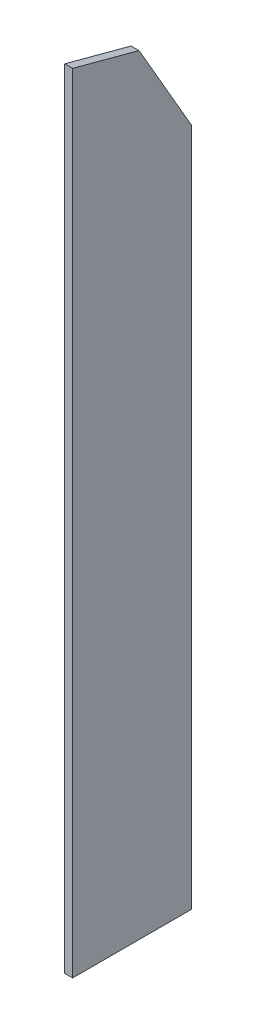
from build123d import *

# Parameters (mm, degrees)
SKETCH1_W               = 50.8
SKETCH1_H               = 762
BOSS_EXTRUDE1_DEPTH     = 5101.6125
CHAMFER1_SIZE           = 20
CUT_EXTRUDE1_DEPTH      = 5116.882744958
CUT_EXTRUDE1_DEPTH_BACK = 5116.882744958


with BuildPart() as part:
    # Sketch1 → Boss-Extrude1 (new body)
    with BuildSketch(Plane(origin=(0, 0, 0), x_dir=(-1, 0, 0), z_dir=(0, 1, 0))):
        Rectangle(SKETCH1_W, SKETCH1_H)
    extrude(amount=BOSS_EXTRUDE1_DEPTH)

    # Chamfer1
    chamfer1_edges = [part.edges().sort_by_distance(p)[0] for p in [
        (0, 0, -381),
        (25.4, 0, 0),
        (0, 0, 381),
        (-25.4, 0, 0),
    ]]
    chamfer(chamfer1_edges, length=CHAMFER1_SIZE)

    # Sketch2 → Cut-Extrude1 (cut, two sides: drawn at the far end of the back side and taken through both)
    with BuildSketch(Plane.YZ.offset(-CUT_EXTRUDE1_DEPTH_BACK)):
        Polygon((5101.6125, 485.605005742), (5101.6125, -381), (4380.429711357, -381), (4380.429711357, -379.700961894), (4959.30710999, -45.485939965), align=None)
    extrude(amount=CUT_EXTRUDE1_DEPTH + CUT_EXTRUDE1_DEPTH_BACK, mode=Mode.SUBTRACT)


solid = part.part
